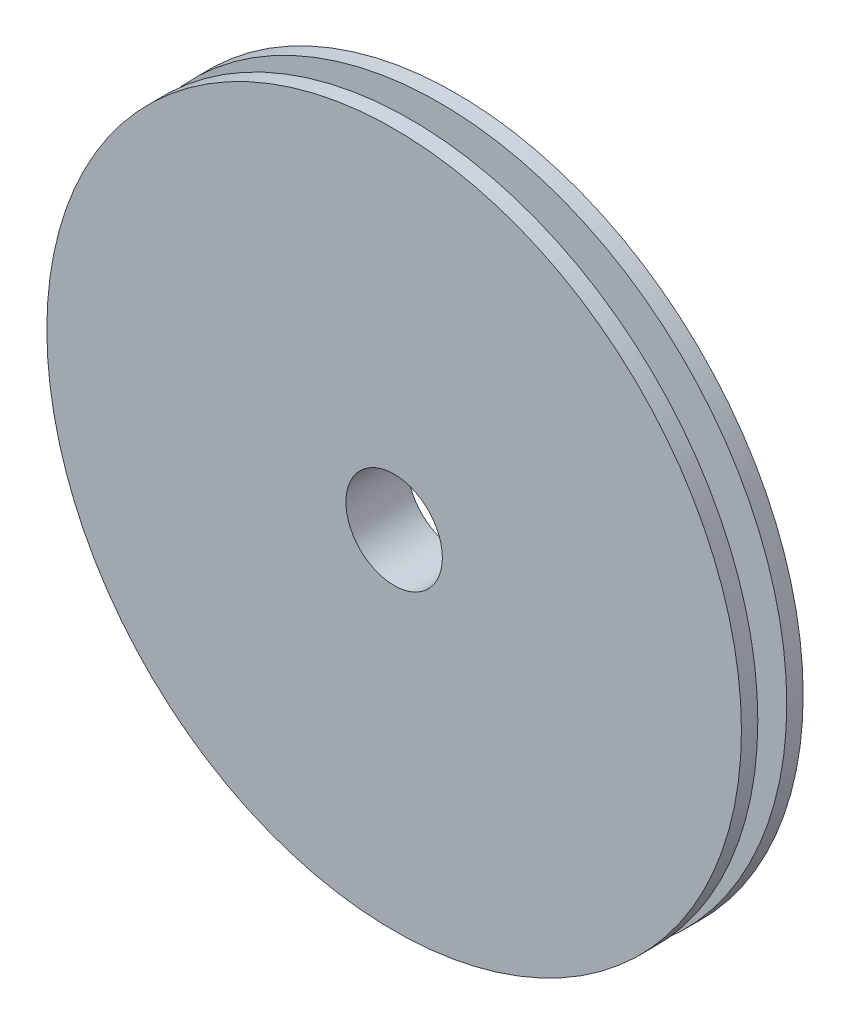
ISO-10303-21;
HEADER;
FILE_DESCRIPTION(('STEP AP214'),'2;1');
FILE_NAME('part.step','',(''),(''),'','','');
FILE_SCHEMA(('AUTOMOTIVE_DESIGN { 1 0 10303 214 1 1 1 1 }'));
ENDSEC;
DATA;
#1=APPLICATION_CONTEXT('core data for automotive mechanical design processes');
#2=APPLICATION_PROTOCOL_DEFINITION('international standard','automotive_design',2000,#1);
#3=PRODUCT_CONTEXT('',#1,'mechanical');
#4=PRODUCT('Part','Part','',(#3));
#5=PRODUCT_RELATED_PRODUCT_CATEGORY('part','',(#4));
#6=PRODUCT_DEFINITION_FORMATION('','',#4);
#7=PRODUCT_DEFINITION_CONTEXT('part definition',#1,'design');
#8=PRODUCT_DEFINITION('design','',#6,#7);
#9=PRODUCT_DEFINITION_SHAPE('','',#8);
#10=(LENGTH_UNIT() NAMED_UNIT(*) SI_UNIT(.MILLI.,.METRE.));
#11=(NAMED_UNIT(*) PLANE_ANGLE_UNIT() SI_UNIT($,.RADIAN.));
#12=(NAMED_UNIT(*) SI_UNIT($,.STERADIAN.) SOLID_ANGLE_UNIT());
#13=UNCERTAINTY_MEASURE_WITH_UNIT(LENGTH_MEASURE(1.E-05),#10,'distance_accuracy_value','');
#14=(GEOMETRIC_REPRESENTATION_CONTEXT(3) GLOBAL_UNCERTAINTY_ASSIGNED_CONTEXT((#13)) GLOBAL_UNIT_ASSIGNED_CONTEXT((#10,
#11,#12)) REPRESENTATION_CONTEXT('',''));
#15=CARTESIAN_POINT('',(0.,0.,0.));
#16=DIRECTION('',(0.,0.,1.));
#17=DIRECTION('',(1.,0.,0.));
#18=AXIS2_PLACEMENT_3D('',#15,#16,#17);
#19=CARTESIAN_POINT('',(0.,0.,3.2));
#20=DIRECTION('',(0.,0.,-1.));
#21=DIRECTION('',(-1.,0.,0.));
#22=AXIS2_PLACEMENT_3D('',#19,#20,#21);
#23=CYLINDRICAL_SURFACE('',#22,18.);
#24=CARTESIAN_POINT('',(0.,0.,0.));
#25=DIRECTION('',(0.,0.,1.));
#26=DIRECTION('',(1.,0.,0.));
#27=AXIS2_PLACEMENT_3D('',#24,#25,#26);
#28=CIRCLE('',#27,18.);
#29=CARTESIAN_POINT('',(18.,0.,0.));
#30=VERTEX_POINT('',#29);
#31=EDGE_CURVE('E50',#30,#30,#28,.T.);
#32=ORIENTED_EDGE('',*,*,#31,.T.);
#33=EDGE_LOOP('',(#32));
#34=FACE_BOUND('',#33,.T.);
#35=CARTESIAN_POINT('',(0.,0.,0.85));
#36=DIRECTION('',(0.,0.,1.));
#37=DIRECTION('',(1.,0.,0.));
#38=AXIS2_PLACEMENT_3D('',#35,#36,#37);
#39=CIRCLE('',#38,18.);
#40=CARTESIAN_POINT('',(18.,0.,0.85));
#41=VERTEX_POINT('',#40);
#42=EDGE_CURVE('E62',#41,#41,#39,.T.);
#43=ORIENTED_EDGE('',*,*,#42,.F.);
#44=EDGE_LOOP('',(#43));
#45=FACE_BOUND('',#44,.T.);
#46=ADVANCED_FACE('F42',(#34,#45),#23,.T.);
#47=CARTESIAN_POINT('',(0.,0.,2.35));
#48=DIRECTION('',(0.,0.,1.));
#49=DIRECTION('',(1.,0.,0.));
#50=AXIS2_PLACEMENT_3D('',#47,#48,#49);
#51=CIRCLE('',#50,18.);
#52=CARTESIAN_POINT('',(18.,0.,2.35));
#53=VERTEX_POINT('',#52);
#54=EDGE_CURVE('E59',#53,#53,#51,.T.);
#55=ORIENTED_EDGE('',*,*,#54,.T.);
#56=EDGE_LOOP('',(#55));
#57=FACE_BOUND('',#56,.T.);
#58=CARTESIAN_POINT('',(0.,0.,3.2));
#59=DIRECTION('',(0.,0.,1.));
#60=DIRECTION('',(1.,0.,0.));
#61=AXIS2_PLACEMENT_3D('',#58,#59,#60);
#62=CIRCLE('',#61,18.);
#63=CARTESIAN_POINT('',(18.,0.,3.2));
#64=VERTEX_POINT('',#63);
#65=EDGE_CURVE('E11',#64,#64,#62,.T.);
#66=ORIENTED_EDGE('',*,*,#65,.F.);
#67=EDGE_LOOP('',(#66));
#68=FACE_BOUND('',#67,.T.);
#69=ADVANCED_FACE('F44',(#57,#68),#23,.T.);
#70=CARTESIAN_POINT('',(0.,0.,3.2));
#71=DIRECTION('',(0.,0.,1.));
#72=DIRECTION('',(1.,0.,0.));
#73=AXIS2_PLACEMENT_3D('',#70,#71,#72);
#74=PLANE('',#73);
#75=CARTESIAN_POINT('',(0.,0.,3.2));
#76=DIRECTION('',(0.,0.,1.));
#77=DIRECTION('',(1.,0.,0.));
#78=AXIS2_PLACEMENT_3D('',#75,#76,#77);
#79=CIRCLE('',#78,2.5);
#80=CARTESIAN_POINT('',(2.5,0.,3.2));
#81=VERTEX_POINT('',#80);
#82=EDGE_CURVE('E55',#81,#81,#79,.F.);
#83=ORIENTED_EDGE('',*,*,#82,.T.);
#84=EDGE_LOOP('',(#83));
#85=FACE_BOUND('',#84,.T.);
#86=ORIENTED_EDGE('',*,*,#65,.T.);
#87=EDGE_LOOP('',(#86));
#88=FACE_BOUND('',#87,.T.);
#89=ADVANCED_FACE('F88',(#85,#88),#74,.T.);
#90=CARTESIAN_POINT('',(0.,0.,0.));
#91=DIRECTION('',(0.,0.,1.));
#92=DIRECTION('',(1.,0.,0.));
#93=AXIS2_PLACEMENT_3D('',#90,#91,#92);
#94=PLANE('',#93);
#95=CARTESIAN_POINT('',(0.,0.,0.));
#96=DIRECTION('',(0.,0.,1.));
#97=DIRECTION('',(1.,0.,0.));
#98=AXIS2_PLACEMENT_3D('',#95,#96,#97);
#99=CIRCLE('',#98,2.5);
#100=CARTESIAN_POINT('',(2.5,0.,0.));
#101=VERTEX_POINT('',#100);
#102=EDGE_CURVE('E46',#101,#101,#99,.F.);
#103=ORIENTED_EDGE('',*,*,#102,.F.);
#104=EDGE_LOOP('',(#103));
#105=FACE_BOUND('',#104,.T.);
#106=ORIENTED_EDGE('',*,*,#31,.F.);
#107=EDGE_LOOP('',(#106));
#108=FACE_BOUND('',#107,.T.);
#109=ADVANCED_FACE('F92',(#105,#108),#94,.F.);
#110=CARTESIAN_POINT('',(0.,0.,20.2));
#111=DIRECTION('',(0.,0.,-1.));
#112=DIRECTION('',(-1.,0.,0.));
#113=AXIS2_PLACEMENT_3D('',#110,#111,#112);
#114=CYLINDRICAL_SURFACE('',#113,2.5);
#115=ORIENTED_EDGE('',*,*,#82,.F.);
#116=EDGE_LOOP('',(#115));
#117=FACE_BOUND('',#116,.T.);
#118=ORIENTED_EDGE('',*,*,#102,.T.);
#119=EDGE_LOOP('',(#118));
#120=FACE_BOUND('',#119,.T.);
#121=ADVANCED_FACE('F79',(#117,#120),#114,.F.);
#122=CARTESIAN_POINT('',(0.,0.,0.85));
#123=DIRECTION('',(0.,0.,1.));
#124=DIRECTION('',(1.,0.,0.));
#125=AXIS2_PLACEMENT_3D('',#122,#123,#124);
#126=PLANE('',#125);
#127=CARTESIAN_POINT('',(0.,0.,0.85));
#128=DIRECTION('',(0.,0.,1.));
#129=DIRECTION('',(1.,0.,0.));
#130=AXIS2_PLACEMENT_3D('',#127,#128,#129);
#131=CIRCLE('',#130,15.5);
#132=CARTESIAN_POINT('',(15.5,0.,0.85));
#133=VERTEX_POINT('',#132);
#134=EDGE_CURVE('E63',#133,#133,#131,.T.);
#135=ORIENTED_EDGE('',*,*,#134,.F.);
#136=EDGE_LOOP('',(#135));
#137=FACE_BOUND('',#136,.T.);
#138=ORIENTED_EDGE('',*,*,#42,.T.);
#139=EDGE_LOOP('',(#138));
#140=FACE_BOUND('',#139,.T.);
#141=ADVANCED_FACE('F75',(#137,#140),#126,.T.);
#142=CARTESIAN_POINT('',(0.,0.,2.35));
#143=DIRECTION('',(0.,0.,1.));
#144=DIRECTION('',(1.,0.,0.));
#145=AXIS2_PLACEMENT_3D('',#142,#143,#144);
#146=PLANE('',#145);
#147=CARTESIAN_POINT('',(0.,0.,2.35));
#148=DIRECTION('',(0.,0.,1.));
#149=DIRECTION('',(1.,0.,0.));
#150=AXIS2_PLACEMENT_3D('',#147,#148,#149);
#151=CIRCLE('',#150,15.5);
#152=CARTESIAN_POINT('',(15.5,0.,2.35));
#153=VERTEX_POINT('',#152);
#154=EDGE_CURVE('E66',#153,#153,#151,.T.);
#155=ORIENTED_EDGE('',*,*,#154,.T.);
#156=EDGE_LOOP('',(#155));
#157=FACE_BOUND('',#156,.T.);
#158=ORIENTED_EDGE('',*,*,#54,.F.);
#159=EDGE_LOOP('',(#158));
#160=FACE_BOUND('',#159,.T.);
#161=ADVANCED_FACE('F78',(#157,#160),#146,.F.);
#162=CARTESIAN_POINT('',(0.,0.,0.85));
#163=DIRECTION('',(0.,0.,1.));
#164=DIRECTION('',(1.,0.,0.));
#165=AXIS2_PLACEMENT_3D('',#162,#163,#164);
#166=CYLINDRICAL_SURFACE('',#165,15.5);
#167=ORIENTED_EDGE('',*,*,#134,.T.);
#168=EDGE_LOOP('',(#167));
#169=FACE_BOUND('',#168,.T.);
#170=ORIENTED_EDGE('',*,*,#154,.F.);
#171=EDGE_LOOP('',(#170));
#172=FACE_BOUND('',#171,.T.);
#173=ADVANCED_FACE('F72',(#169,#172),#166,.T.);
#174=CLOSED_SHELL('',(#46,#69,#89,#109,#121,#141,#161,#173));
#175=MANIFOLD_SOLID_BREP('B2',#174);
#176=ADVANCED_BREP_SHAPE_REPRESENTATION('',(#18,#175),#14);
#177=SHAPE_DEFINITION_REPRESENTATION(#9,#176);
ENDSEC;
END-ISO-10303-21;
